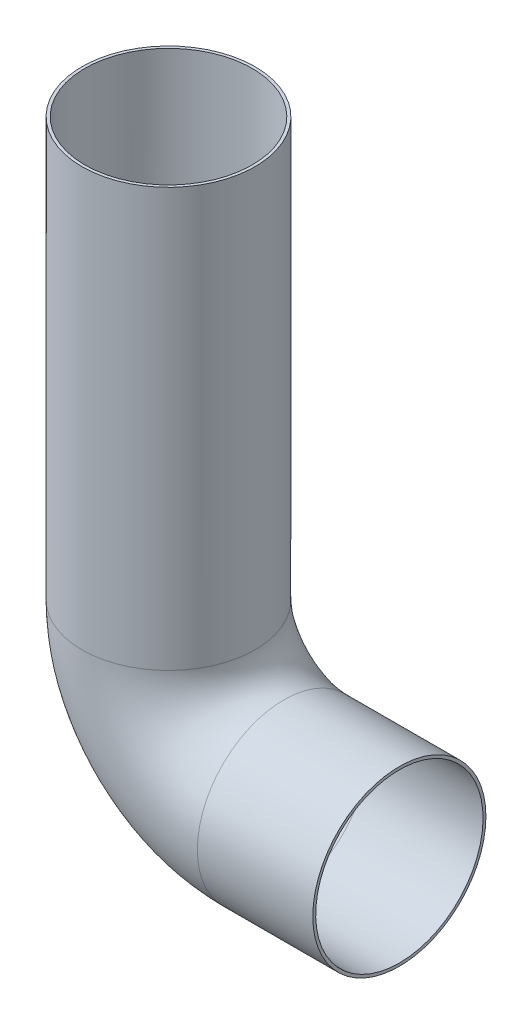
from build123d import *

# Parameters (mm, degrees)
SKETCH3_R  = 76.2
SKETCH10_R = 73.66


with BuildPart() as part:
    # Sweep1: sweep along a path in Sketch2
    with BuildLine(Plane.XY) as sweep1_path:
        Line((0, 0), (0, -368.3))
        ThreePointArc((0, -368.3), (29.757951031, -440.142048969), (101.6, -469.9))
        Line((101.6, -469.9), (203.2, -469.9))
    # Sketch3 → Sweep1 (sweep)
    with BuildSketch(Plane(origin=(0, 0, 0), x_dir=(1, 0, 0), z_dir=(0, 1, 0))):
        Circle(SKETCH3_R)
    sweep(path=sweep1_path.line)

    # Cut-Sweep1: sweep along a path in Sketch2_3
    with BuildLine(Plane.XY) as cut_sweep1_path:
        Line((0, 0), (0, -368.3))
        ThreePointArc((0, -368.3), (29.757951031, -440.142048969), (101.6, -469.9))
        Line((101.6, -469.9), (203.2, -469.9))
    # Sketch10 → Cut-Sweep1 (sweep, cut)
    with BuildSketch(Plane(origin=(0, 0, 0), x_dir=(1, 0, 0), z_dir=(0, 1, 0))):
        Circle(SKETCH10_R)
    sweep(path=cut_sweep1_path.line, mode=Mode.SUBTRACT)


solid = part.part
